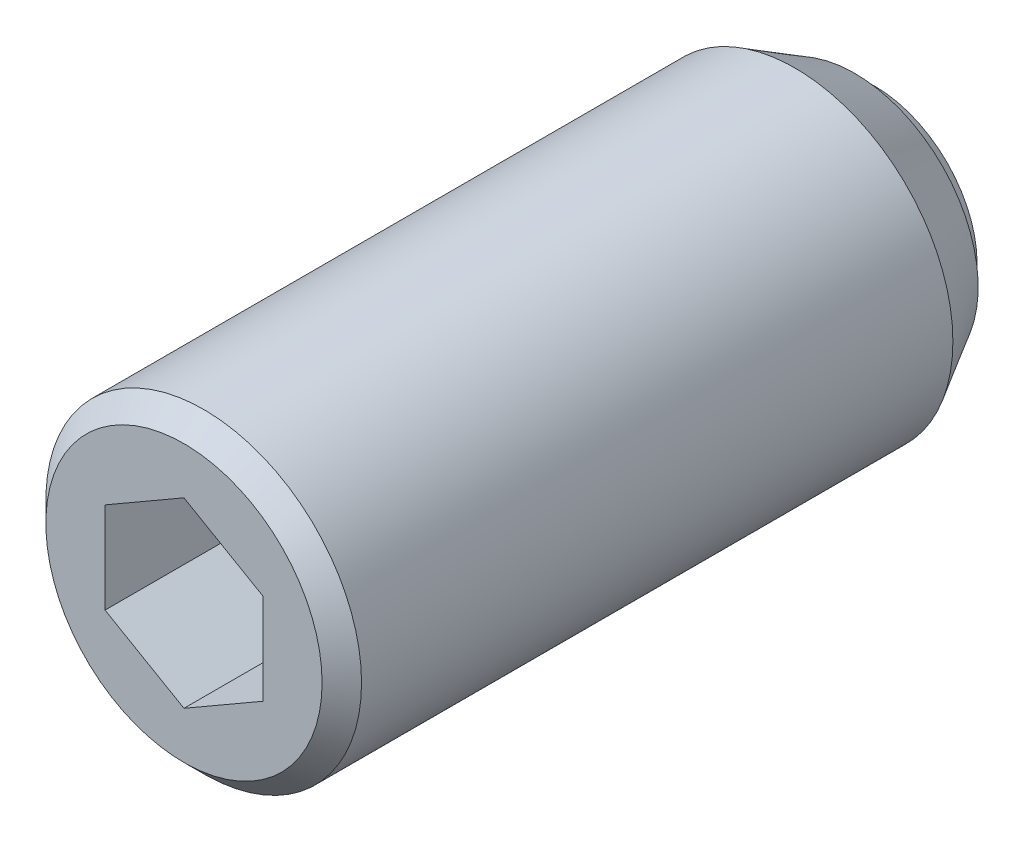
ISO-10303-21;
HEADER;
FILE_DESCRIPTION(('STEP AP214'),'2;1');
FILE_NAME('part.step','',(''),(''),'','','');
FILE_SCHEMA(('AUTOMOTIVE_DESIGN { 1 0 10303 214 1 1 1 1 }'));
ENDSEC;
DATA;
#1=APPLICATION_CONTEXT('core data for automotive mechanical design processes');
#2=APPLICATION_PROTOCOL_DEFINITION('international standard','automotive_design',2000,#1);
#3=PRODUCT_CONTEXT('',#1,'mechanical');
#4=PRODUCT('Part','Part','',(#3));
#5=PRODUCT_RELATED_PRODUCT_CATEGORY('part','',(#4));
#6=PRODUCT_DEFINITION_FORMATION('','',#4);
#7=PRODUCT_DEFINITION_CONTEXT('part definition',#1,'design');
#8=PRODUCT_DEFINITION('design','',#6,#7);
#9=PRODUCT_DEFINITION_SHAPE('','',#8);
#10=(LENGTH_UNIT() NAMED_UNIT(*) SI_UNIT(.MILLI.,.METRE.));
#11=(NAMED_UNIT(*) PLANE_ANGLE_UNIT() SI_UNIT($,.RADIAN.));
#12=(NAMED_UNIT(*) SI_UNIT($,.STERADIAN.) SOLID_ANGLE_UNIT());
#13=UNCERTAINTY_MEASURE_WITH_UNIT(LENGTH_MEASURE(1.E-05),#10,'distance_accuracy_value','');
#14=(GEOMETRIC_REPRESENTATION_CONTEXT(3) GLOBAL_UNCERTAINTY_ASSIGNED_CONTEXT((#13)) GLOBAL_UNIT_ASSIGNED_CONTEXT((#10,
#11,#12)) REPRESENTATION_CONTEXT('',''));
#15=CARTESIAN_POINT('',(0.,0.,0.));
#16=DIRECTION('',(0.,0.,1.));
#17=DIRECTION('',(1.,0.,0.));
#18=AXIS2_PLACEMENT_3D('',#15,#16,#17);
#19=CARTESIAN_POINT('',(4.,2.30940107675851,32.5));
#20=DIRECTION('',(0.5,0.86602540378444,0.));
#21=DIRECTION('',(0.86602540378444,-0.5,0.));
#22=AXIS2_PLACEMENT_3D('',#19,#20,#21);
#23=PLANE('',#22);
#24=DIRECTION('',(0.,0.,1.));
#25=VECTOR('',#24,1.);
#26=CARTESIAN_POINT('',(4.,2.30940107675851,32.5));
#27=LINE('',#26,#25);
#28=CARTESIAN_POINT('',(4.,2.30940107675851,29.));
#29=VERTEX_POINT('',#28);
#30=CARTESIAN_POINT('',(4.,2.30940107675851,35.));
#31=VERTEX_POINT('',#30);
#32=EDGE_CURVE('E68',#29,#31,#27,.T.);
#33=ORIENTED_EDGE('',*,*,#32,.T.);
#34=DIRECTION('',(-0.86602540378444,0.5,0.));
#35=VECTOR('',#34,1.);
#36=CARTESIAN_POINT('',(4.,2.30940107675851,35.));
#37=LINE('',#36,#35);
#38=CARTESIAN_POINT('',(0.,4.618802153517,35.));
#39=VERTEX_POINT('',#38);
#40=EDGE_CURVE('E29',#31,#39,#37,.T.);
#41=ORIENTED_EDGE('',*,*,#40,.T.);
#42=DIRECTION('',(0.,0.,1.));
#43=VECTOR('',#42,1.);
#44=CARTESIAN_POINT('',(0.,4.618802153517,32.5));
#45=LINE('',#44,#43);
#46=CARTESIAN_POINT('',(0.,4.618802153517,29.));
#47=VERTEX_POINT('',#46);
#48=EDGE_CURVE('E80',#47,#39,#45,.T.);
#49=ORIENTED_EDGE('',*,*,#48,.F.);
#50=DIRECTION('',(-0.86602540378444,0.5,0.));
#51=VECTOR('',#50,1.);
#52=CARTESIAN_POINT('',(4.,2.30940107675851,29.));
#53=LINE('',#52,#51);
#54=EDGE_CURVE('E79',#29,#47,#53,.T.);
#55=ORIENTED_EDGE('',*,*,#54,.F.);
#56=EDGE_LOOP('',(#33,#41,#49,#55));
#57=FACE_BOUND('',#56,.T.);
#58=ADVANCED_FACE('F14',(#57),#23,.F.);
#59=CARTESIAN_POINT('',(4.,-2.30940107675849,32.5));
#60=DIRECTION('',(1.,0.,0.));
#61=DIRECTION('',(0.,-1.,0.));
#62=AXIS2_PLACEMENT_3D('',#59,#60,#61);
#63=PLANE('',#62);
#64=DIRECTION('',(0.,0.,1.));
#65=VECTOR('',#64,1.);
#66=CARTESIAN_POINT('',(4.,-2.30940107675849,32.5));
#67=LINE('',#66,#65);
#68=CARTESIAN_POINT('',(4.,-2.30940107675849,29.));
#69=VERTEX_POINT('',#68);
#70=CARTESIAN_POINT('',(4.,-2.30940107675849,35.));
#71=VERTEX_POINT('',#70);
#72=EDGE_CURVE('E76',#69,#71,#67,.T.);
#73=ORIENTED_EDGE('',*,*,#72,.T.);
#74=DIRECTION('',(0.,1.,0.));
#75=VECTOR('',#74,1.);
#76=CARTESIAN_POINT('',(4.,-2.30940107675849,35.));
#77=LINE('',#76,#75);
#78=EDGE_CURVE('E75',#71,#31,#77,.T.);
#79=ORIENTED_EDGE('',*,*,#78,.T.);
#80=ORIENTED_EDGE('',*,*,#32,.F.);
#81=DIRECTION('',(0.,1.,0.));
#82=VECTOR('',#81,1.);
#83=CARTESIAN_POINT('',(4.,-2.30940107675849,29.));
#84=LINE('',#83,#82);
#85=EDGE_CURVE('E72',#69,#29,#84,.T.);
#86=ORIENTED_EDGE('',*,*,#85,.F.);
#87=EDGE_LOOP('',(#73,#79,#80,#86));
#88=FACE_BOUND('',#87,.T.);
#89=ADVANCED_FACE('F70',(#88),#63,.F.);
#90=CARTESIAN_POINT('',(4.,-2.30940107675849,32.5));
#91=DIRECTION('',(-0.5,0.866025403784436,0.));
#92=DIRECTION('',(0.866025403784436,0.5,0.));
#93=AXIS2_PLACEMENT_3D('',#90,#91,#92);
#94=PLANE('',#93);
#95=DIRECTION('',(0.,0.,1.));
#96=VECTOR('',#95,1.);
#97=CARTESIAN_POINT('',(0.,-4.61880215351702,32.5));
#98=LINE('',#97,#96);
#99=CARTESIAN_POINT('',(0.,-4.61880215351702,29.));
#100=VERTEX_POINT('',#99);
#101=CARTESIAN_POINT('',(0.,-4.61880215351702,35.));
#102=VERTEX_POINT('',#101);
#103=EDGE_CURVE('E122',#100,#102,#98,.T.);
#104=ORIENTED_EDGE('',*,*,#103,.T.);
#105=DIRECTION('',(-0.866025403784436,-0.5,0.));
#106=VECTOR('',#105,1.);
#107=CARTESIAN_POINT('',(4.,-2.30940107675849,35.));
#108=LINE('',#107,#106);
#109=EDGE_CURVE('E113',#71,#102,#108,.T.);
#110=ORIENTED_EDGE('',*,*,#109,.F.);
#111=ORIENTED_EDGE('',*,*,#72,.F.);
#112=DIRECTION('',(0.866025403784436,0.5,0.));
#113=VECTOR('',#112,1.);
#114=CARTESIAN_POINT('',(0.,-4.61880215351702,29.));
#115=LINE('',#114,#113);
#116=EDGE_CURVE('E89',#100,#69,#115,.T.);
#117=ORIENTED_EDGE('',*,*,#116,.F.);
#118=EDGE_LOOP('',(#104,#110,#111,#117));
#119=FACE_BOUND('',#118,.T.);
#120=ADVANCED_FACE('F147',(#119),#94,.T.);
#121=CARTESIAN_POINT('',(-4.,-2.30940107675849,32.5));
#122=DIRECTION('',(-0.5,-0.866025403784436,0.));
#123=DIRECTION('',(-0.866025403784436,0.5,0.));
#124=AXIS2_PLACEMENT_3D('',#121,#122,#123);
#125=PLANE('',#124);
#126=DIRECTION('',(0.,0.,1.));
#127=VECTOR('',#126,1.);
#128=CARTESIAN_POINT('',(-4.,-2.30940107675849,32.5));
#129=LINE('',#128,#127);
#130=CARTESIAN_POINT('',(-4.,-2.30940107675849,29.));
#131=VERTEX_POINT('',#130);
#132=CARTESIAN_POINT('',(-4.,-2.30940107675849,35.));
#133=VERTEX_POINT('',#132);
#134=EDGE_CURVE('E120',#131,#133,#129,.T.);
#135=ORIENTED_EDGE('',*,*,#134,.T.);
#136=DIRECTION('',(0.866025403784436,-0.5,0.));
#137=VECTOR('',#136,1.);
#138=CARTESIAN_POINT('',(-4.,-2.30940107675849,35.));
#139=LINE('',#138,#137);
#140=EDGE_CURVE('E111',#133,#102,#139,.T.);
#141=ORIENTED_EDGE('',*,*,#140,.T.);
#142=ORIENTED_EDGE('',*,*,#103,.F.);
#143=DIRECTION('',(0.866025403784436,-0.5,0.));
#144=VECTOR('',#143,1.);
#145=CARTESIAN_POINT('',(-4.,-2.30940107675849,29.));
#146=LINE('',#145,#144);
#147=EDGE_CURVE('E101',#131,#100,#146,.T.);
#148=ORIENTED_EDGE('',*,*,#147,.F.);
#149=EDGE_LOOP('',(#135,#141,#142,#148));
#150=FACE_BOUND('',#149,.T.);
#151=ADVANCED_FACE('F157',(#150),#125,.F.);
#152=CARTESIAN_POINT('',(-4.,-2.30940107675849,32.5));
#153=DIRECTION('',(1.,0.,0.));
#154=DIRECTION('',(0.,-1.,0.));
#155=AXIS2_PLACEMENT_3D('',#152,#153,#154);
#156=PLANE('',#155);
#157=DIRECTION('',(0.,0.,1.));
#158=VECTOR('',#157,1.);
#159=CARTESIAN_POINT('',(-4.,2.30940107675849,32.5));
#160=LINE('',#159,#158);
#161=CARTESIAN_POINT('',(-4.,2.30940107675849,29.));
#162=VERTEX_POINT('',#161);
#163=CARTESIAN_POINT('',(-4.,2.30940107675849,35.));
#164=VERTEX_POINT('',#163);
#165=EDGE_CURVE('E37',#162,#164,#160,.T.);
#166=ORIENTED_EDGE('',*,*,#165,.T.);
#167=DIRECTION('',(0.,1.,0.));
#168=VECTOR('',#167,1.);
#169=CARTESIAN_POINT('',(-4.,-2.30940107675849,35.));
#170=LINE('',#169,#168);
#171=EDGE_CURVE('E108',#133,#164,#170,.T.);
#172=ORIENTED_EDGE('',*,*,#171,.F.);
#173=ORIENTED_EDGE('',*,*,#134,.F.);
#174=DIRECTION('',(0.,-1.,0.));
#175=VECTOR('',#174,1.);
#176=CARTESIAN_POINT('',(-4.,2.30940107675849,29.));
#177=LINE('',#176,#175);
#178=EDGE_CURVE('E98',#162,#131,#177,.T.);
#179=ORIENTED_EDGE('',*,*,#178,.F.);
#180=EDGE_LOOP('',(#166,#172,#173,#179));
#181=FACE_BOUND('',#180,.T.);
#182=ADVANCED_FACE('F153',(#181),#156,.T.);
#183=CARTESIAN_POINT('',(-4.,2.30940107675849,32.5));
#184=DIRECTION('',(0.5,-0.866025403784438,0.));
#185=DIRECTION('',(-0.866025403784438,-0.5,0.));
#186=AXIS2_PLACEMENT_3D('',#183,#184,#185);
#187=PLANE('',#186);
#188=ORIENTED_EDGE('',*,*,#165,.F.);
#189=DIRECTION('',(-0.866025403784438,-0.5,0.));
#190=VECTOR('',#189,1.);
#191=CARTESIAN_POINT('',(0.,4.618802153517,29.));
#192=LINE('',#191,#190);
#193=EDGE_CURVE('E84',#47,#162,#192,.T.);
#194=ORIENTED_EDGE('',*,*,#193,.F.);
#195=ORIENTED_EDGE('',*,*,#48,.T.);
#196=DIRECTION('',(0.866025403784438,0.5,0.));
#197=VECTOR('',#196,1.);
#198=CARTESIAN_POINT('',(-4.,2.30940107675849,35.));
#199=LINE('',#198,#197);
#200=EDGE_CURVE('E105',#164,#39,#199,.T.);
#201=ORIENTED_EDGE('',*,*,#200,.F.);
#202=EDGE_LOOP('',(#188,#194,#195,#201));
#203=FACE_BOUND('',#202,.T.);
#204=ADVANCED_FACE('F150',(#203),#187,.T.);
#205=CARTESIAN_POINT('',(0.,0.,34.75));
#206=DIRECTION('',(0.,0.,-1.));
#207=DIRECTION('',(1.,0.,0.));
#208=AXIS2_PLACEMENT_3D('',#205,#206,#207);
#209=CYLINDRICAL_SURFACE('',#208,8.);
#210=CARTESIAN_POINT('',(0.,0.,34.));
#211=DIRECTION('',(0.,0.,-1.));
#212=DIRECTION('',(1.,0.,0.));
#213=AXIS2_PLACEMENT_3D('',#210,#211,#212);
#214=CIRCLE('',#213,8.);
#215=CARTESIAN_POINT('',(8.,0.,34.));
#216=VERTEX_POINT('',#215);
#217=EDGE_CURVE('E9',#216,#216,#214,.T.);
#218=ORIENTED_EDGE('',*,*,#217,.T.);
#219=EDGE_LOOP('',(#218));
#220=FACE_BOUND('',#219,.T.);
#221=CARTESIAN_POINT('',(0.,0.,4.03108891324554));
#222=DIRECTION('',(0.,0.,-1.));
#223=DIRECTION('',(-1.,0.,0.));
#224=AXIS2_PLACEMENT_3D('',#221,#222,#223);
#225=CIRCLE('',#224,8.);
#226=CARTESIAN_POINT('',(-8.,0.,4.03108891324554));
#227=VERTEX_POINT('',#226);
#228=EDGE_CURVE('E260',#227,#227,#225,.T.);
#229=ORIENTED_EDGE('',*,*,#228,.F.);
#230=EDGE_LOOP('',(#229));
#231=FACE_BOUND('',#230,.T.);
#232=ADVANCED_FACE('F16',(#220,#231),#209,.T.);
#233=CARTESIAN_POINT('',(0.,0.,34.));
#234=DIRECTION('',(0.,0.,-1.));
#235=DIRECTION('',(1.,0.,0.));
#236=AXIS2_PLACEMENT_3D('',#233,#234,#235);
#237=CONICAL_SURFACE('',#236,8.,0.785398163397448);
#238=CARTESIAN_POINT('',(0.,0.,35.));
#239=DIRECTION('',(0.,0.,-1.));
#240=DIRECTION('',(1.,0.,0.));
#241=AXIS2_PLACEMENT_3D('',#238,#239,#240);
#242=CIRCLE('',#241,7.);
#243=CARTESIAN_POINT('',(7.,0.,35.));
#244=VERTEX_POINT('',#243);
#245=EDGE_CURVE('E22',#244,#244,#242,.T.);
#246=ORIENTED_EDGE('',*,*,#245,.T.);
#247=EDGE_LOOP('',(#246));
#248=FACE_BOUND('',#247,.T.);
#249=ORIENTED_EDGE('',*,*,#217,.F.);
#250=EDGE_LOOP('',(#249));
#251=FACE_BOUND('',#250,.T.);
#252=ADVANCED_FACE('F127',(#248,#251),#237,.T.);
#253=CARTESIAN_POINT('',(0.,0.,35.));
#254=DIRECTION('',(0.,0.,-1.));
#255=DIRECTION('',(1.,0.,0.));
#256=AXIS2_PLACEMENT_3D('',#253,#254,#255);
#257=PLANE('',#256);
#258=ORIENTED_EDGE('',*,*,#200,.T.);
#259=ORIENTED_EDGE('',*,*,#40,.F.);
#260=ORIENTED_EDGE('',*,*,#78,.F.);
#261=ORIENTED_EDGE('',*,*,#109,.T.);
#262=ORIENTED_EDGE('',*,*,#140,.F.);
#263=ORIENTED_EDGE('',*,*,#171,.T.);
#264=EDGE_LOOP('',(#258,#259,#260,#261,#262,#263));
#265=FACE_BOUND('',#264,.T.);
#266=ORIENTED_EDGE('',*,*,#245,.F.);
#267=EDGE_LOOP('',(#266));
#268=FACE_BOUND('',#267,.T.);
#269=ADVANCED_FACE('F130',(#265,#268),#257,.F.);
#270=CARTESIAN_POINT('',(4.,2.30940107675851,29.));
#271=DIRECTION('',(0.,0.,1.));
#272=DIRECTION('',(1.,0.,0.));
#273=AXIS2_PLACEMENT_3D('',#270,#271,#272);
#274=PLANE('',#273);
#275=ORIENTED_EDGE('',*,*,#85,.T.);
#276=ORIENTED_EDGE('',*,*,#54,.T.);
#277=ORIENTED_EDGE('',*,*,#193,.T.);
#278=ORIENTED_EDGE('',*,*,#178,.T.);
#279=ORIENTED_EDGE('',*,*,#147,.T.);
#280=ORIENTED_EDGE('',*,*,#116,.T.);
#281=EDGE_LOOP('',(#275,#276,#277,#278,#279,#280));
#282=FACE_BOUND('',#281,.T.);
#283=ADVANCED_FACE('F86',(#282),#274,.T.);
#284=CARTESIAN_POINT('',(0.,0.,0.));
#285=DIRECTION('',(0.,0.,-1.));
#286=DIRECTION('',(-1.,0.,0.));
#287=AXIS2_PLACEMENT_3D('',#284,#285,#286);
#288=PLANE('',#287);
#289=CARTESIAN_POINT('',(0.,0.,0.));
#290=DIRECTION('',(0.,0.,-1.));
#291=DIRECTION('',(-1.,0.,0.));
#292=AXIS2_PLACEMENT_3D('',#289,#290,#291);
#293=CIRCLE('',#292,5.19615242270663);
#294=CARTESIAN_POINT('',(-5.19615242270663,0.,0.));
#295=VERTEX_POINT('',#294);
#296=EDGE_CURVE('E90',#295,#295,#293,.T.);
#297=ORIENTED_EDGE('',*,*,#296,.T.);
#298=EDGE_LOOP('',(#297));
#299=FACE_BOUND('',#298,.T.);
#300=ADVANCED_FACE('F139',(#299),#288,.T.);
#301=CARTESIAN_POINT('',(0.,0.,3.));
#302=DIRECTION('',(0.,0.,-1.));
#303=DIRECTION('',(-1.,0.,0.));
#304=AXIS2_PLACEMENT_3D('',#301,#302,#303);
#305=SPHERICAL_SURFACE('',#304,6.);
#306=CARTESIAN_POINT('',(0.,0.,1.));
#307=DIRECTION('',(0.,0.,-1.));
#308=DIRECTION('',(-1.,0.,0.));
#309=AXIS2_PLACEMENT_3D('',#306,#307,#308);
#310=CIRCLE('',#309,5.65685424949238);
#311=CARTESIAN_POINT('',(-5.65685424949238,0.,1.));
#312=VERTEX_POINT('',#311);
#313=EDGE_CURVE('E93',#312,#312,#310,.T.);
#314=CARTESIAN_POINT('',(-5.65685424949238,0.,1.));
#315=CARTESIAN_POINT('',(-5.65302587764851,0.,0.989171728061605));
#316=CARTESIAN_POINT('',(-5.64916641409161,0.,0.978354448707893));
#317=CARTESIAN_POINT('',(-5.64138543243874,0.,0.956742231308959));
#318=CARTESIAN_POINT('',(-5.63746391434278,0.,0.945947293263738));
#319=CARTESIAN_POINT('',(-5.62955895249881,0.,0.924380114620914));
#320=CARTESIAN_POINT('',(-5.62557550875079,0.,0.913607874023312));
#321=CARTESIAN_POINT('',(-5.61754682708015,0.,0.892086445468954));
#322=CARTESIAN_POINT('',(-5.61350158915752,0.,0.881337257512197));
#323=CARTESIAN_POINT('',(-5.60534945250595,0.,0.859862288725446));
#324=CARTESIAN_POINT('',(-5.60124255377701,0.,0.849136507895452));
#325=CARTESIAN_POINT('',(-5.59296723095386,0.,0.827708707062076));
#326=CARTESIAN_POINT('',(-5.58879880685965,0.,0.817006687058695));
#327=CARTESIAN_POINT('',(-5.58040057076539,0.,0.795626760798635));
#328=CARTESIAN_POINT('',(-5.57617075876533,0.,0.784948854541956));
#329=CARTESIAN_POINT('',(-5.56764988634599,0.,0.763617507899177));
#330=CARTESIAN_POINT('',(-5.56335882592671,0.,0.752964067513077));
#331=CARTESIAN_POINT('',(-5.55471559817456,0.,0.731682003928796));
#332=CARTESIAN_POINT('',(-5.55036343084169,0.,0.721053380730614));
#333=CARTESIAN_POINT('',(-5.54159813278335,0.,0.699821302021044));
#334=CARTESIAN_POINT('',(-5.53718500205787,0.,0.689217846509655));
#335=CARTESIAN_POINT('',(-5.52829792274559,0.,0.668036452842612));
#336=CARTESIAN_POINT('',(-5.52382397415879,0.,0.657458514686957));
#337=CARTESIAN_POINT('',(-5.51481540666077,0.,0.636328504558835));
#338=CARTESIAN_POINT('',(-5.51028078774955,0.,0.625776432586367));
#339=CARTESIAN_POINT('',(-5.50115102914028,0.,0.604698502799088));
#340=CARTESIAN_POINT('',(-5.49655588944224,0.,0.594172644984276));
#341=CARTESIAN_POINT('',(-5.48730524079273,0.,0.573147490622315));
#342=CARTESIAN_POINT('',(-5.48264973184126,0.,0.562648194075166));
#343=CARTESIAN_POINT('',(-5.47327849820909,0.,0.541676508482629));
#344=CARTESIAN_POINT('',(-5.46856277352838,0.,0.531204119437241));
#345=CARTESIAN_POINT('',(-5.45907126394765,0.,0.510286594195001));
#346=CARTESIAN_POINT('',(-5.45429547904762,0.,0.499841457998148));
#347=CARTESIAN_POINT('',(-5.44468400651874,0.,0.478978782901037));
#348=CARTESIAN_POINT('',(-5.43984831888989,0.,0.468561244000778));
#349=CARTESIAN_POINT('',(-5.4301172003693,0.,0.447754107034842));
#350=CARTESIAN_POINT('',(-5.42522176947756,0.,0.437364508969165));
#351=CARTESIAN_POINT('',(-5.41537132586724,0.,0.416613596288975));
#352=CARTESIAN_POINT('',(-5.41041631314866,0.,0.406252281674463));
#353=CARTESIAN_POINT('',(-5.40044686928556,0.,0.385558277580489));
#354=CARTESIAN_POINT('',(-5.39543243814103,0.,0.375225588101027));
#355=CARTESIAN_POINT('',(-5.38534432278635,0.,0.354589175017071));
#356=CARTESIAN_POINT('',(-5.3802706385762,0.,0.344285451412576));
#357=CARTESIAN_POINT('',(-5.37006418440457,0.,0.323707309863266));
#358=CARTESIAN_POINT('',(-5.3649314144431,0.,0.313432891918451));
#359=CARTESIAN_POINT('',(-5.35460695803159,0.,0.292913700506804));
#360=CARTESIAN_POINT('',(-5.34941527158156,0.,0.282668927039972));
#361=CARTESIAN_POINT('',(-5.33897315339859,0.,0.262209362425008));
#362=CARTESIAN_POINT('',(-5.33372272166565,0.,0.251994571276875));
#363=CARTESIAN_POINT('',(-5.32316328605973,0.,0.231595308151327));
#364=CARTESIAN_POINT('',(-5.31785428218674,0.,0.221410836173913));
#365=CARTESIAN_POINT('',(-5.30717787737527,0.,0.201072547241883));
#366=CARTESIAN_POINT('',(-5.30181047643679,0.,0.190918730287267));
#367=CARTESIAN_POINT('',(-5.29101745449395,0.,0.170642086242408));
#368=CARTESIAN_POINT('',(-5.28559183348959,0.,0.160519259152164));
#369=CARTESIAN_POINT('',(-5.27468255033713,0.,0.140304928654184));
#370=CARTESIAN_POINT('',(-5.26919888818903,0.,0.130213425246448));
#371=CARTESIAN_POINT('',(-5.25817370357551,0.,0.110062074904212));
#372=CARTESIAN_POINT('',(-5.25263218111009,0.,0.100002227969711));
#373=CARTESIAN_POINT('',(-5.24149145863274,0.,0.0799145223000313));
#374=CARTESIAN_POINT('',(-5.23589225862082,0.,0.0698866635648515));
#375=CARTESIAN_POINT('',(-5.22463636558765,0.,0.0498632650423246));
#376=CARTESIAN_POINT('',(-5.21897967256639,0.,0.0398677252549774));
#377=CARTESIAN_POINT('',(-5.20760898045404,0.,0.019909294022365));
#378=CARTESIAN_POINT('',(-5.20189498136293,0.,0.0099464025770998));
#379=CARTESIAN_POINT('',(-5.19615242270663,0.,0.));
#380=B_SPLINE_CURVE_WITH_KNOTS('',3,(#314,#315,#316,#317,#318,#319,#320,#321,#322,#323,#324,
#325,#326,#327,#328,#329,#330,#331,#332,#333,#334,#335,#336,#337,#338,#339,#340,#341,#342,#343,
#344,#345,#346,#347,#348,#349,#350,#351,#352,#353,#354,#355,#356,#357,#358,#359,#360,#361,#362,
#363,#364,#365,#366,#367,#368,#369,#370,#371,#372,#373,#374,#375,#376,#377,#378,#379),
.UNSPECIFIED.,.F.,.F.,(4,2,2,2,2,2,2,2,2,2,2,2,2,2,2,2,2,2,2,2,2,2,2,2,2,2,2,2,2,2,2,2,4),(0.,
0.0344553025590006,0.0689106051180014,0.103365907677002,0.137821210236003,0.172276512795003,
0.206731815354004,0.241187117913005,0.275642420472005,0.310097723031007,0.344553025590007,
0.379008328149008,0.413463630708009,0.44791893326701,0.48237423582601,0.516829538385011,
0.551284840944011,0.585740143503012,0.620195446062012,0.654650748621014,0.689106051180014,
0.723561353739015,0.758016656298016,0.792471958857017,0.826927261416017,0.861382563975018,
0.895837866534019,0.930293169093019,0.96474847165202,0.99920377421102,1.03365907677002,
1.06811437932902,1.10256968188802),.UNSPECIFIED.);
#381=EDGE_CURVE('BSEAM223',#312,#295,#380,.T.);
#382=ORIENTED_EDGE('',*,*,#313,.T.);
#383=ORIENTED_EDGE('',*,*,#296,.F.);
#384=ORIENTED_EDGE('',*,*,#381,.T.);
#385=ORIENTED_EDGE('',*,*,#381,.F.);
#386=EDGE_LOOP('',(#382,#384,#383,#385));
#387=FACE_BOUND('',#386,.T.);
#388=ADVANCED_FACE('F223',(#387),#305,.T.);
#389=CARTESIAN_POINT('',(-5.65685424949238,0.,1.));
#390=DIRECTION('',(0.,0.,-1.));
#391=DIRECTION('',(-1.,0.,0.));
#392=AXIS2_PLACEMENT_3D('',#389,#390,#391);
#393=PLANE('',#392);
#394=CARTESIAN_POINT('',(0.,0.,1.));
#395=DIRECTION('',(0.,0.,-1.));
#396=DIRECTION('',(-1.,0.,0.));
#397=AXIS2_PLACEMENT_3D('',#394,#395,#396);
#398=CIRCLE('',#397,6.25);
#399=CARTESIAN_POINT('',(-6.25,0.,1.));
#400=VERTEX_POINT('',#399);
#401=EDGE_CURVE('E263',#400,#400,#398,.T.);
#402=ORIENTED_EDGE('',*,*,#401,.T.);
#403=EDGE_LOOP('',(#402));
#404=FACE_BOUND('',#403,.T.);
#405=ORIENTED_EDGE('',*,*,#313,.F.);
#406=EDGE_LOOP('',(#405));
#407=FACE_BOUND('',#406,.T.);
#408=ADVANCED_FACE('F232',(#404,#407),#393,.T.);
#409=CARTESIAN_POINT('',(0.,0.,1.));
#410=DIRECTION('',(0.,0.,1.));
#411=DIRECTION('',(1.,0.,0.));
#412=AXIS2_PLACEMENT_3D('',#409,#410,#411);
#413=CONICAL_SURFACE('',#412,6.25,0.523598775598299);
#414=ORIENTED_EDGE('',*,*,#228,.T.);
#415=EDGE_LOOP('',(#414));
#416=FACE_BOUND('',#415,.T.);
#417=ORIENTED_EDGE('',*,*,#401,.F.);
#418=EDGE_LOOP('',(#417));
#419=FACE_BOUND('',#418,.T.);
#420=ADVANCED_FACE('F242',(#416,#419),#413,.T.);
#421=CLOSED_SHELL('',(#58,#89,#120,#151,#182,#204,#232,#252,#269,#283,#300,#388,#408,#420));
#422=MANIFOLD_SOLID_BREP('B1',#421);
#423=ADVANCED_BREP_SHAPE_REPRESENTATION('',(#18,#422),#14);
#424=SHAPE_DEFINITION_REPRESENTATION(#9,#423);
ENDSEC;
END-ISO-10303-21;
